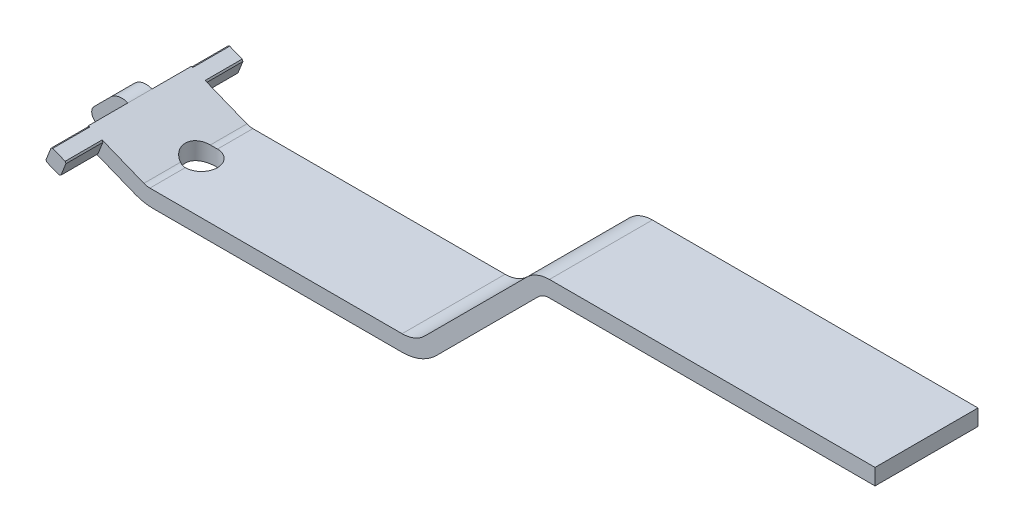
ISO-10303-21;
HEADER;
FILE_DESCRIPTION(('STEP AP214'),'2;1');
FILE_NAME('part.step','',(''),(''),'','','');
FILE_SCHEMA(('AUTOMOTIVE_DESIGN { 1 0 10303 214 1 1 1 1 }'));
ENDSEC;
DATA;
#1=APPLICATION_CONTEXT('core data for automotive mechanical design processes');
#2=APPLICATION_PROTOCOL_DEFINITION('international standard','automotive_design',2000,#1);
#3=PRODUCT_CONTEXT('',#1,'mechanical');
#4=PRODUCT('Part','Part','',(#3));
#5=PRODUCT_RELATED_PRODUCT_CATEGORY('part','',(#4));
#6=PRODUCT_DEFINITION_FORMATION('','',#4);
#7=PRODUCT_DEFINITION_CONTEXT('part definition',#1,'design');
#8=PRODUCT_DEFINITION('design','',#6,#7);
#9=PRODUCT_DEFINITION_SHAPE('','',#8);
#10=(LENGTH_UNIT() NAMED_UNIT(*) SI_UNIT(.MILLI.,.METRE.));
#11=(NAMED_UNIT(*) PLANE_ANGLE_UNIT() SI_UNIT($,.RADIAN.));
#12=(NAMED_UNIT(*) SI_UNIT($,.STERADIAN.) SOLID_ANGLE_UNIT());
#13=UNCERTAINTY_MEASURE_WITH_UNIT(LENGTH_MEASURE(1.E-05),#10,'distance_accuracy_value','');
#14=(GEOMETRIC_REPRESENTATION_CONTEXT(3) GLOBAL_UNCERTAINTY_ASSIGNED_CONTEXT((#13)) GLOBAL_UNIT_ASSIGNED_CONTEXT((#10,
#11,#12)) REPRESENTATION_CONTEXT('',''));
#15=CARTESIAN_POINT('',(0.,0.,0.));
#16=DIRECTION('',(0.,0.,1.));
#17=DIRECTION('',(1.,0.,0.));
#18=AXIS2_PLACEMENT_3D('',#15,#16,#17);
#19=CARTESIAN_POINT('',(3.73112428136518,1.2,3.2));
#20=DIRECTION('',(0.,0.,-1.));
#21=DIRECTION('',(-1.,0.,0.));
#22=AXIS2_PLACEMENT_3D('',#19,#20,#21);
#23=CYLINDRICAL_SURFACE('',#22,3.);
#24=CARTESIAN_POINT('',(2.61683856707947,-1.58538459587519,-0.387945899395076));
#25=CARTESIAN_POINT('',(2.639047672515,-1.59426285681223,-0.440770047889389));
#26=CARTESIAN_POINT('',(2.66571598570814,-1.60463297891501,-0.491380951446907));
#27=CARTESIAN_POINT('',(2.72699278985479,-1.62715226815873,-0.587054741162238));
#28=CARTESIAN_POINT('',(2.76159483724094,-1.63929998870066,-0.632122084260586));
#29=CARTESIAN_POINT('',(2.83776356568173,-1.66417616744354,-0.715636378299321));
#30=CARTESIAN_POINT('',(2.87932357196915,-1.67690406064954,-0.754089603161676));
#31=CARTESIAN_POINT('',(2.96843372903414,-1.70179977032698,-0.823522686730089));
#32=CARTESIAN_POINT('',(3.01598406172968,-1.7139675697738,-0.854502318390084));
#33=CARTESIAN_POINT('',(3.1167874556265,-1.73688632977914,-0.908550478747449));
#34=CARTESIAN_POINT('',(3.17012227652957,-1.74761033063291,-0.931478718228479));
#35=CARTESIAN_POINT('',(3.28035079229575,-1.76646697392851,-0.967840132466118));
#36=CARTESIAN_POINT('',(3.33724266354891,-1.7746009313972,-0.981278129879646));
#37=CARTESIAN_POINT('',(3.45048145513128,-1.78736378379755,-0.997686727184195));
#38=CARTESIAN_POINT('',(3.50675199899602,-1.79212481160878,-1.00107083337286));
#39=CARTESIAN_POINT('',(3.59114023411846,-1.79686651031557,-0.999014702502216));
#40=CARTESIAN_POINT('',(3.6193198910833,-1.79804704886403,-0.997130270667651));
#41=CARTESIAN_POINT('',(3.67544696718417,-1.79961498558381,-0.990983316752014));
#42=CARTESIAN_POINT('',(3.7033943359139,-1.80000221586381,-0.986720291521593));
#43=CARTESIAN_POINT('',(3.73112428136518,-1.8,-0.981276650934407));
#44=B_SPLINE_CURVE_WITH_KNOTS('',3,(#24,#25,#26,#27,#28,#29,#30,#31,#32,#33,#34,#35,#36,#37,#38,
#39,#40,#41,#42,#43),.UNSPECIFIED.,.F.,.F.,(4,2,2,2,2,2,2,2,2,4),(0.,0.173622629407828,
0.347104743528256,0.520421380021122,0.693743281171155,0.869950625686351,1.0460683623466,
1.2148347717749,1.29953835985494,1.38425987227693),.UNSPECIFIED.);
#45=CARTESIAN_POINT('',(2.61683856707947,-1.58538459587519,-0.387945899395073));
#46=VERTEX_POINT('',#45);
#47=CARTESIAN_POINT('',(3.73112428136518,-1.8,-0.981276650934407));
#48=VERTEX_POINT('',#47);
#49=EDGE_CURVE('E295',#46,#48,#44,.T.);
#50=ORIENTED_EDGE('',*,*,#49,.F.);
#51=DIRECTION('',(0.,0.,-1.));
#52=VECTOR('',#51,1.);
#53=CARTESIAN_POINT('',(2.61683856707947,-1.58538459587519,3.2));
#54=LINE('',#53,#52);
#55=CARTESIAN_POINT('',(2.61683856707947,-1.58538459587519,-3.2));
#56=VERTEX_POINT('',#55);
#57=EDGE_CURVE('E326',#56,#46,#54,.F.);
#58=ORIENTED_EDGE('',*,*,#57,.F.);
#59=CARTESIAN_POINT('',(3.73112428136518,1.2,-3.2));
#60=DIRECTION('',(0.,0.,1.));
#61=DIRECTION('',(1.,0.,0.));
#62=AXIS2_PLACEMENT_3D('',#59,#60,#61);
#63=CIRCLE('',#62,3.);
#64=CARTESIAN_POINT('',(3.73112428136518,-1.8,-3.2));
#65=VERTEX_POINT('',#64);
#66=EDGE_CURVE('E314',#65,#56,#63,.F.);
#67=ORIENTED_EDGE('',*,*,#66,.F.);
#68=DIRECTION('',(0.,0.,-1.));
#69=VECTOR('',#68,1.);
#70=CARTESIAN_POINT('',(3.73112428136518,-1.8,3.2));
#71=LINE('',#70,#69);
#72=EDGE_CURVE('E308',#48,#65,#71,.T.);
#73=ORIENTED_EDGE('',*,*,#72,.F.);
#74=EDGE_LOOP('',(#50,#58,#67,#73));
#75=FACE_BOUND('',#74,.T.);
#76=ADVANCED_FACE('F34',(#75),#23,.T.);
#77=CARTESIAN_POINT('',(3.53852071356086,0.2,3.2));
#78=DIRECTION('',(0.,0.,1.));
#79=DIRECTION('',(1.,0.,0.));
#80=AXIS2_PLACEMENT_3D('',#77,#78,#79);
#81=CYLINDRICAL_SURFACE('',#80,1.);
#82=DIRECTION('',(0.,0.,-1.));
#83=VECTOR('',#82,1.);
#84=CARTESIAN_POINT('',(3.53852071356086,-0.8,3.2));
#85=LINE('',#84,#83);
#86=CARTESIAN_POINT('',(3.53852071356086,-0.8,1.));
#87=VERTEX_POINT('',#86);
#88=CARTESIAN_POINT('',(3.53852071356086,-0.8,3.2));
#89=VERTEX_POINT('',#88);
#90=EDGE_CURVE('E334',#87,#89,#85,.F.);
#91=ORIENTED_EDGE('',*,*,#90,.F.);
#92=CARTESIAN_POINT('',(3.53852071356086,0.2,0.));
#93=DIRECTION('',(0.,0.707106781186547,0.707106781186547));
#94=DIRECTION('',(0.,-0.707106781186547,0.707106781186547));
#95=AXIS2_PLACEMENT_3D('',#92,#93,#94);
#96=ELLIPSE('',#95,1.41421356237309,1.);
#97=CARTESIAN_POINT('',(3.16709214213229,-0.728461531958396,0.928461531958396));
#98=VERTEX_POINT('',#97);
#99=EDGE_CURVE('E12',#87,#98,#96,.F.);
#100=ORIENTED_EDGE('',*,*,#99,.T.);
#101=DIRECTION('',(0.,0.,-1.));
#102=VECTOR('',#101,1.);
#103=CARTESIAN_POINT('',(3.16709214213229,-0.728461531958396,-3.2));
#104=LINE('',#103,#102);
#105=CARTESIAN_POINT('',(3.16709214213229,-0.728461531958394,3.2));
#106=VERTEX_POINT('',#105);
#107=EDGE_CURVE('E331',#106,#98,#104,.T.);
#108=ORIENTED_EDGE('',*,*,#107,.F.);
#109=CARTESIAN_POINT('',(3.53852071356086,0.2,3.2));
#110=DIRECTION('',(0.,0.,1.));
#111=DIRECTION('',(1.,0.,0.));
#112=AXIS2_PLACEMENT_3D('',#109,#110,#111);
#113=CIRCLE('',#112,1.);
#114=EDGE_CURVE('E340',#89,#106,#113,.F.);
#115=ORIENTED_EDGE('',*,*,#114,.F.);
#116=EDGE_LOOP('',(#91,#100,#108,#115));
#117=FACE_BOUND('',#116,.T.);
#118=ADVANCED_FACE('F651',(#117),#81,.F.);
#119=CARTESIAN_POINT('',(-0.278516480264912,0.649945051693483,3.2));
#120=DIRECTION('',(0.928461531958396,-0.371428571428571,0.));
#121=DIRECTION('',(0.371428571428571,0.928461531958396,0.));
#122=AXIS2_PLACEMENT_3D('',#119,#120,#121);
#123=PLANE('',#122);
#124=DIRECTION('',(0.371428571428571,0.928461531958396,0.));
#125=VECTOR('',#124,1.);
#126=CARTESIAN_POINT('',(-0.278516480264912,0.649945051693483,0.75));
#127=LINE('',#126,#125);
#128=CARTESIAN_POINT('',(-0.649945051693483,-0.278516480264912,0.75));
#129=VERTEX_POINT('',#128);
#130=CARTESIAN_POINT('',(-0.278516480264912,0.649945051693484,0.75));
#131=VERTEX_POINT('',#130);
#132=EDGE_CURVE('E428',#129,#131,#127,.T.);
#133=ORIENTED_EDGE('',*,*,#132,.F.);
#134=DIRECTION('',(0.,0.,-1.));
#135=VECTOR('',#134,1.);
#136=CARTESIAN_POINT('',(-0.649945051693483,-0.278516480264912,3.2));
#137=LINE('',#136,#135);
#138=CARTESIAN_POINT('',(-0.649945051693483,-0.278516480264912,3.2));
#139=VERTEX_POINT('',#138);
#140=EDGE_CURVE('E379',#139,#129,#137,.T.);
#141=ORIENTED_EDGE('',*,*,#140,.F.);
#142=DIRECTION('',(-0.371428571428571,-0.928461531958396,0.));
#143=VECTOR('',#142,1.);
#144=CARTESIAN_POINT('',(-0.278516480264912,0.649945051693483,3.2));
#145=LINE('',#144,#143);
#146=CARTESIAN_POINT('',(-0.618496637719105,-0.199904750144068,3.2));
#147=VERTEX_POINT('',#146);
#148=EDGE_CURVE('E544',#147,#139,#145,.T.);
#149=ORIENTED_EDGE('',*,*,#148,.F.);
#150=DIRECTION('',(0.,0.,1.));
#151=VECTOR('',#150,1.);
#152=CARTESIAN_POINT('',(-0.618496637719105,-0.199904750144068,-47.2865977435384));
#153=LINE('',#152,#151);
#154=CARTESIAN_POINT('',(-0.618496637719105,-0.199904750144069,5.5));
#155=VERTEX_POINT('',#154);
#156=EDGE_CURVE('E530',#155,#147,#153,.F.);
#157=ORIENTED_EDGE('',*,*,#156,.F.);
#158=DIRECTION('',(-0.371428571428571,-0.928461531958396,0.));
#159=VECTOR('',#158,1.);
#160=CARTESIAN_POINT('',(-0.278516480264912,0.649945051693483,5.5));
#161=LINE('',#160,#159);
#162=CARTESIAN_POINT('',(-0.309964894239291,0.57133332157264,5.5));
#163=VERTEX_POINT('',#162);
#164=EDGE_CURVE('E549',#163,#155,#161,.T.);
#165=ORIENTED_EDGE('',*,*,#164,.F.);
#166=DIRECTION('',(0.,0.,1.));
#167=VECTOR('',#166,1.);
#168=CARTESIAN_POINT('',(-0.309964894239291,0.57133332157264,-47.2865977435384));
#169=LINE('',#168,#167);
#170=CARTESIAN_POINT('',(-0.309964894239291,0.57133332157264,3.2));
#171=VERTEX_POINT('',#170);
#172=EDGE_CURVE('E532',#171,#163,#169,.T.);
#173=ORIENTED_EDGE('',*,*,#172,.F.);
#174=CARTESIAN_POINT('',(-0.278516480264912,0.649945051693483,3.2));
#175=VERTEX_POINT('',#174);
#176=EDGE_CURVE('E542',#175,#171,#145,.T.);
#177=ORIENTED_EDGE('',*,*,#176,.F.);
#178=DIRECTION('',(0.,0.,-1.));
#179=VECTOR('',#178,1.);
#180=CARTESIAN_POINT('',(-0.278516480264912,0.649945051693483,3.2));
#181=LINE('',#180,#179);
#182=EDGE_CURVE('E418',#175,#131,#181,.T.);
#183=ORIENTED_EDGE('',*,*,#182,.T.);
#184=EDGE_LOOP('',(#133,#141,#149,#157,#165,#173,#177,#183));
#185=FACE_BOUND('',#184,.T.);
#186=ADVANCED_FACE('F656',(#185),#123,.F.);
#187=CARTESIAN_POINT('',(0.185714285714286,0.464230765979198,3.2));
#188=DIRECTION('',(-0.371428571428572,-0.928461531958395,0.));
#189=DIRECTION('',(0.928461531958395,-0.371428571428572,0.));
#190=AXIS2_PLACEMENT_3D('',#187,#188,#189);
#191=PLANE('',#190);
#192=ORIENTED_EDGE('',*,*,#107,.T.);
#193=CARTESIAN_POINT('',(3.53852071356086,-0.877050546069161,0.));
#194=DIRECTION('',(-0.371428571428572,-0.928461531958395,0.));
#195=DIRECTION('',(-0.928461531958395,0.371428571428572,0.));
#196=AXIS2_PLACEMENT_3D('',#193,#194,#195);
#197=ELLIPSE('',#196,1.07705054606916,1.);
#198=CARTESIAN_POINT('',(3.16709214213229,-0.728461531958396,-0.928461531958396));
#199=VERTEX_POINT('',#198);
#200=EDGE_CURVE('E672',#98,#199,#197,.T.);
#201=ORIENTED_EDGE('',*,*,#200,.T.);
#202=CARTESIAN_POINT('',(3.16709214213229,-0.728461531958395,-3.2));
#203=VERTEX_POINT('',#202);
#204=EDGE_CURVE('E330',#199,#203,#104,.T.);
#205=ORIENTED_EDGE('',*,*,#204,.T.);
#206=DIRECTION('',(-0.928461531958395,0.371428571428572,0.));
#207=VECTOR('',#206,1.);
#208=CARTESIAN_POINT('',(0.185714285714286,0.464230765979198,-3.2));
#209=LINE('',#208,#207);
#210=CARTESIAN_POINT('',(0.57133332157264,0.309964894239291,-3.2));
#211=VERTEX_POINT('',#210);
#212=EDGE_CURVE('E358',#203,#211,#209,.T.);
#213=ORIENTED_EDGE('',*,*,#212,.T.);
#214=DIRECTION('',(0.,0.,-1.));
#215=VECTOR('',#214,1.);
#216=CARTESIAN_POINT('',(0.57133332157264,0.309964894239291,47.2865977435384));
#217=LINE('',#216,#215);
#218=CARTESIAN_POINT('',(0.57133332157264,0.309964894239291,-5.5));
#219=VERTEX_POINT('',#218);
#220=EDGE_CURVE('E508',#219,#211,#217,.F.);
#221=ORIENTED_EDGE('',*,*,#220,.F.);
#222=DIRECTION('',(-0.928461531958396,0.371428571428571,0.));
#223=VECTOR('',#222,1.);
#224=CARTESIAN_POINT('',(-0.278516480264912,0.649945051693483,-5.5));
#225=LINE('',#224,#223);
#226=CARTESIAN_POINT('',(-0.199904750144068,0.618496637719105,-5.5));
#227=VERTEX_POINT('',#226);
#228=EDGE_CURVE('E541',#219,#227,#225,.T.);
#229=ORIENTED_EDGE('',*,*,#228,.T.);
#230=DIRECTION('',(0.,0.,-1.));
#231=VECTOR('',#230,1.);
#232=CARTESIAN_POINT('',(-0.199904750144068,0.618496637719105,47.2865977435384));
#233=LINE('',#232,#231);
#234=CARTESIAN_POINT('',(-0.199904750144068,0.618496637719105,-3.2));
#235=VERTEX_POINT('',#234);
#236=EDGE_CURVE('E511',#235,#227,#233,.T.);
#237=ORIENTED_EDGE('',*,*,#236,.F.);
#238=DIRECTION('',(-0.928461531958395,0.371428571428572,0.));
#239=VECTOR('',#238,1.);
#240=CARTESIAN_POINT('',(0.185714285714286,0.464230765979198,-3.2));
#241=LINE('',#240,#239);
#242=CARTESIAN_POINT('',(-0.278516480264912,0.649945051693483,-3.2));
#243=VERTEX_POINT('',#242);
#244=EDGE_CURVE('E491',#235,#243,#241,.T.);
#245=ORIENTED_EDGE('',*,*,#244,.T.);
#246=CARTESIAN_POINT('',(-0.278516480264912,0.649945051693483,-0.75));
#247=VERTEX_POINT('',#246);
#248=EDGE_CURVE('E381',#247,#243,#181,.T.);
#249=ORIENTED_EDGE('',*,*,#248,.F.);
#250=DIRECTION('',(0.,0.,-1.));
#251=VECTOR('',#250,1.);
#252=CARTESIAN_POINT('',(-0.278516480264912,0.649945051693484,0.75));
#253=LINE('',#252,#251);
#254=EDGE_CURVE('E435',#131,#247,#253,.T.);
#255=ORIENTED_EDGE('',*,*,#254,.F.);
#256=ORIENTED_EDGE('',*,*,#182,.F.);
#257=DIRECTION('',(-0.928461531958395,0.371428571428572,0.));
#258=VECTOR('',#257,1.);
#259=CARTESIAN_POINT('',(0.185714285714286,0.464230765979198,3.2));
#260=LINE('',#259,#258);
#261=CARTESIAN_POINT('',(-0.199904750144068,0.618496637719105,3.2));
#262=VERTEX_POINT('',#261);
#263=EDGE_CURVE('E539',#262,#175,#260,.T.);
#264=ORIENTED_EDGE('',*,*,#263,.F.);
#265=DIRECTION('',(0.,0.,1.));
#266=VECTOR('',#265,1.);
#267=CARTESIAN_POINT('',(-0.199904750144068,0.618496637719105,-47.2865977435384));
#268=LINE('',#267,#266);
#269=CARTESIAN_POINT('',(-0.199904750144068,0.618496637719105,5.5));
#270=VERTEX_POINT('',#269);
#271=EDGE_CURVE('E534',#270,#262,#268,.F.);
#272=ORIENTED_EDGE('',*,*,#271,.F.);
#273=DIRECTION('',(-0.928461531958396,0.371428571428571,0.));
#274=VECTOR('',#273,1.);
#275=CARTESIAN_POINT('',(-0.278516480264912,0.649945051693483,5.5));
#276=LINE('',#275,#274);
#277=CARTESIAN_POINT('',(0.57133332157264,0.309964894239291,5.5));
#278=VERTEX_POINT('',#277);
#279=EDGE_CURVE('E546',#278,#270,#276,.T.);
#280=ORIENTED_EDGE('',*,*,#279,.F.);
#281=DIRECTION('',(0.,0.,1.));
#282=VECTOR('',#281,1.);
#283=CARTESIAN_POINT('',(0.57133332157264,0.309964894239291,-47.2865977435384));
#284=LINE('',#283,#282);
#285=CARTESIAN_POINT('',(0.57133332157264,0.309964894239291,3.2));
#286=VERTEX_POINT('',#285);
#287=EDGE_CURVE('E536',#286,#278,#284,.T.);
#288=ORIENTED_EDGE('',*,*,#287,.F.);
#289=DIRECTION('',(-0.928461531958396,0.371428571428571,0.));
#290=VECTOR('',#289,1.);
#291=CARTESIAN_POINT('',(0.185714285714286,0.464230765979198,3.2));
#292=LINE('',#291,#290);
#293=EDGE_CURVE('E595',#106,#286,#292,.T.);
#294=ORIENTED_EDGE('',*,*,#293,.F.);
#295=EDGE_LOOP('',(#192,#201,#205,#213,#221,#229,#237,#245,#249,#255,#256,#264,#272,#280,#288,#294));
#296=FACE_BOUND('',#295,.T.);
#297=ADVANCED_FACE('F771',(#296),#191,.F.);
#298=CARTESIAN_POINT('',(-0.649945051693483,-0.278516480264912,-0.75));
#299=VERTEX_POINT('',#298);
#300=CARTESIAN_POINT('',(-0.649945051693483,-0.278516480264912,-3.2));
#301=VERTEX_POINT('',#300);
#302=EDGE_CURVE('E376',#299,#301,#137,.T.);
#303=ORIENTED_EDGE('',*,*,#302,.F.);
#304=DIRECTION('',(0.371428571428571,0.928461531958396,0.));
#305=VECTOR('',#304,1.);
#306=CARTESIAN_POINT('',(-0.278516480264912,0.649945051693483,-0.75));
#307=LINE('',#306,#305);
#308=EDGE_CURVE('E303',#299,#247,#307,.T.);
#309=ORIENTED_EDGE('',*,*,#308,.T.);
#310=ORIENTED_EDGE('',*,*,#248,.T.);
#311=DIRECTION('',(-0.371428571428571,-0.928461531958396,0.));
#312=VECTOR('',#311,1.);
#313=CARTESIAN_POINT('',(-0.278516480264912,0.649945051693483,-3.2));
#314=LINE('',#313,#312);
#315=CARTESIAN_POINT('',(-0.309964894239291,0.57133332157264,-3.2));
#316=VERTEX_POINT('',#315);
#317=EDGE_CURVE('E495',#243,#316,#314,.T.);
#318=ORIENTED_EDGE('',*,*,#317,.T.);
#319=DIRECTION('',(0.,0.,-1.));
#320=VECTOR('',#319,1.);
#321=CARTESIAN_POINT('',(-0.309964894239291,0.57133332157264,47.2865977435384));
#322=LINE('',#321,#320);
#323=CARTESIAN_POINT('',(-0.309964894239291,0.57133332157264,-5.5));
#324=VERTEX_POINT('',#323);
#325=EDGE_CURVE('E504',#324,#316,#322,.F.);
#326=ORIENTED_EDGE('',*,*,#325,.F.);
#327=DIRECTION('',(-0.371428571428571,-0.928461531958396,0.));
#328=VECTOR('',#327,1.);
#329=CARTESIAN_POINT('',(-0.278516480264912,0.649945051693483,-5.5));
#330=LINE('',#329,#328);
#331=CARTESIAN_POINT('',(-0.618496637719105,-0.199904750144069,-5.5));
#332=VERTEX_POINT('',#331);
#333=EDGE_CURVE('E562',#324,#332,#330,.T.);
#334=ORIENTED_EDGE('',*,*,#333,.T.);
#335=DIRECTION('',(0.,0.,-1.));
#336=VECTOR('',#335,1.);
#337=CARTESIAN_POINT('',(-0.618496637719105,-0.199904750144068,47.2865977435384));
#338=LINE('',#337,#336);
#339=CARTESIAN_POINT('',(-0.618496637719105,-0.199904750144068,-3.2));
#340=VERTEX_POINT('',#339);
#341=EDGE_CURVE('E506',#340,#332,#338,.T.);
#342=ORIENTED_EDGE('',*,*,#341,.F.);
#343=EDGE_CURVE('E498',#340,#301,#314,.T.);
#344=ORIENTED_EDGE('',*,*,#343,.T.);
#345=EDGE_LOOP('',(#303,#309,#310,#318,#326,#334,#342,#344));
#346=FACE_BOUND('',#345,.T.);
#347=ADVANCED_FACE('F767',(#346),#123,.F.);
#348=CARTESIAN_POINT('',(-0.185714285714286,-0.464230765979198,3.2));
#349=DIRECTION('',(0.371428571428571,0.928461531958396,0.));
#350=DIRECTION('',(-0.928461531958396,0.371428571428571,0.));
#351=AXIS2_PLACEMENT_3D('',#348,#349,#350);
#352=PLANE('',#351);
#353=ORIENTED_EDGE('',*,*,#57,.T.);
#354=CARTESIAN_POINT('',(3.53852071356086,-1.95410109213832,0.));
#355=DIRECTION('',(0.371428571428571,0.928461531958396,0.));
#356=DIRECTION('',(-0.928461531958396,0.371428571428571,0.));
#357=AXIS2_PLACEMENT_3D('',#354,#355,#356);
#358=ELLIPSE('',#357,1.07705054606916,1.);
#359=CARTESIAN_POINT('',(2.61683856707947,-1.58538459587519,0.387945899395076));
#360=VERTEX_POINT('',#359);
#361=EDGE_CURVE('E298',#46,#360,#358,.T.);
#362=ORIENTED_EDGE('',*,*,#361,.T.);
#363=CARTESIAN_POINT('',(2.61683856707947,-1.58538459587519,3.2));
#364=VERTEX_POINT('',#363);
#365=EDGE_CURVE('E325',#360,#364,#54,.F.);
#366=ORIENTED_EDGE('',*,*,#365,.T.);
#367=DIRECTION('',(0.928461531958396,-0.371428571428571,0.));
#368=VECTOR('',#367,1.);
#369=CARTESIAN_POINT('',(-0.649945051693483,-0.278516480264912,3.2));
#370=LINE('',#369,#368);
#371=CARTESIAN_POINT('',(0.199904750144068,-0.618496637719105,3.2));
#372=VERTEX_POINT('',#371);
#373=EDGE_CURVE('E597',#372,#364,#370,.T.);
#374=ORIENTED_EDGE('',*,*,#373,.F.);
#375=DIRECTION('',(0.,0.,1.));
#376=VECTOR('',#375,1.);
#377=CARTESIAN_POINT('',(0.199904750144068,-0.618496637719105,-47.2865977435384));
#378=LINE('',#377,#376);
#379=CARTESIAN_POINT('',(0.199904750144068,-0.618496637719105,5.5));
#380=VERTEX_POINT('',#379);
#381=EDGE_CURVE('E525',#380,#372,#378,.F.);
#382=ORIENTED_EDGE('',*,*,#381,.F.);
#383=DIRECTION('',(0.928461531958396,-0.371428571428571,0.));
#384=VECTOR('',#383,1.);
#385=CARTESIAN_POINT('',(-0.649945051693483,-0.278516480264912,5.5));
#386=LINE('',#385,#384);
#387=CARTESIAN_POINT('',(-0.571333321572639,-0.309964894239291,5.5));
#388=VERTEX_POINT('',#387);
#389=EDGE_CURVE('E553',#388,#380,#386,.T.);
#390=ORIENTED_EDGE('',*,*,#389,.F.);
#391=DIRECTION('',(0.,0.,1.));
#392=VECTOR('',#391,1.);
#393=CARTESIAN_POINT('',(-0.57133332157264,-0.309964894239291,-47.2865977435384));
#394=LINE('',#393,#392);
#395=CARTESIAN_POINT('',(-0.57133332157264,-0.309964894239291,3.2));
#396=VERTEX_POINT('',#395);
#397=EDGE_CURVE('E528',#396,#388,#394,.T.);
#398=ORIENTED_EDGE('',*,*,#397,.F.);
#399=DIRECTION('',(0.928461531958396,-0.371428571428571,0.));
#400=VECTOR('',#399,1.);
#401=CARTESIAN_POINT('',(-0.185714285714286,-0.464230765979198,3.2));
#402=LINE('',#401,#400);
#403=EDGE_CURVE('E538',#139,#396,#402,.T.);
#404=ORIENTED_EDGE('',*,*,#403,.F.);
#405=ORIENTED_EDGE('',*,*,#140,.T.);
#406=DIRECTION('',(0.,0.,-1.));
#407=VECTOR('',#406,1.);
#408=CARTESIAN_POINT('',(-0.649945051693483,-0.278516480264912,0.75));
#409=LINE('',#408,#407);
#410=EDGE_CURVE('E476',#129,#299,#409,.T.);
#411=ORIENTED_EDGE('',*,*,#410,.T.);
#412=ORIENTED_EDGE('',*,*,#302,.T.);
#413=DIRECTION('',(0.928461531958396,-0.371428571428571,0.));
#414=VECTOR('',#413,1.);
#415=CARTESIAN_POINT('',(-0.185714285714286,-0.464230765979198,-3.2));
#416=LINE('',#415,#414);
#417=CARTESIAN_POINT('',(-0.57133332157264,-0.309964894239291,-3.2));
#418=VERTEX_POINT('',#417);
#419=EDGE_CURVE('E489',#301,#418,#416,.T.);
#420=ORIENTED_EDGE('',*,*,#419,.T.);
#421=DIRECTION('',(0.,0.,-1.));
#422=VECTOR('',#421,1.);
#423=CARTESIAN_POINT('',(-0.57133332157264,-0.309964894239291,47.2865977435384));
#424=LINE('',#423,#422);
#425=CARTESIAN_POINT('',(-0.571333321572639,-0.309964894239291,-5.5));
#426=VERTEX_POINT('',#425);
#427=EDGE_CURVE('E494',#426,#418,#424,.F.);
#428=ORIENTED_EDGE('',*,*,#427,.F.);
#429=DIRECTION('',(0.928461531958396,-0.371428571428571,0.));
#430=VECTOR('',#429,1.);
#431=CARTESIAN_POINT('',(-0.649945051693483,-0.278516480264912,-5.5));
#432=LINE('',#431,#430);
#433=CARTESIAN_POINT('',(0.199904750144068,-0.618496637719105,-5.5));
#434=VERTEX_POINT('',#433);
#435=EDGE_CURVE('E565',#426,#434,#432,.T.);
#436=ORIENTED_EDGE('',*,*,#435,.T.);
#437=DIRECTION('',(0.,0.,-1.));
#438=VECTOR('',#437,1.);
#439=CARTESIAN_POINT('',(0.199904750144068,-0.618496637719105,47.2865977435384));
#440=LINE('',#439,#438);
#441=CARTESIAN_POINT('',(0.199904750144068,-0.618496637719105,-3.2));
#442=VERTEX_POINT('',#441);
#443=EDGE_CURVE('E502',#442,#434,#440,.T.);
#444=ORIENTED_EDGE('',*,*,#443,.F.);
#445=DIRECTION('',(0.928461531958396,-0.371428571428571,0.));
#446=VECTOR('',#445,1.);
#447=CARTESIAN_POINT('',(-0.185714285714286,-0.464230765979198,-3.2));
#448=LINE('',#447,#446);
#449=EDGE_CURVE('E361',#442,#56,#448,.T.);
#450=ORIENTED_EDGE('',*,*,#449,.T.);
#451=EDGE_LOOP('',(#353,#362,#366,#374,#382,#390,#398,#404,#405,#411,#412,#420,#428,#436,#444,#450));
#452=FACE_BOUND('',#451,.T.);
#453=ADVANCED_FACE('F717',(#452),#352,.F.);
#454=CARTESIAN_POINT('',(0.649945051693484,0.278516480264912,-5.5));
#455=DIRECTION('',(0.,0.,-1.));
#456=DIRECTION('',(-1.,0.,0.));
#457=AXIS2_PLACEMENT_3D('',#454,#455,#456);
#458=PLANE('',#457);
#459=ORIENTED_EDGE('',*,*,#333,.F.);
#460=CARTESIAN_POINT('',(0.,0.,-5.5));
#461=DIRECTION('',(0.,0.,-1.));
#462=DIRECTION('',(-1.,0.,0.));
#463=AXIS2_PLACEMENT_3D('',#460,#461,#462);
#464=CIRCLE('',#463,0.65);
#465=EDGE_CURVE('E480',#324,#227,#464,.T.);
#466=ORIENTED_EDGE('',*,*,#465,.T.);
#467=ORIENTED_EDGE('',*,*,#228,.F.);
#468=CARTESIAN_POINT('',(0.618496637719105,0.199904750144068,-5.5));
#469=VERTEX_POINT('',#468);
#470=EDGE_CURVE('E484',#219,#469,#464,.T.);
#471=ORIENTED_EDGE('',*,*,#470,.T.);
#472=DIRECTION('',(0.371428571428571,0.928461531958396,0.));
#473=VECTOR('',#472,1.);
#474=CARTESIAN_POINT('',(0.649945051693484,0.278516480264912,-5.5));
#475=LINE('',#474,#473);
#476=CARTESIAN_POINT('',(0.309964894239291,-0.571333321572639,-5.5));
#477=VERTEX_POINT('',#476);
#478=EDGE_CURVE('E550',#477,#469,#475,.T.);
#479=ORIENTED_EDGE('',*,*,#478,.F.);
#480=EDGE_CURVE('E791',#477,#434,#464,.T.);
#481=ORIENTED_EDGE('',*,*,#480,.T.);
#482=ORIENTED_EDGE('',*,*,#435,.F.);
#483=EDGE_CURVE('E485',#426,#332,#464,.T.);
#484=ORIENTED_EDGE('',*,*,#483,.T.);
#485=EDGE_LOOP('',(#459,#466,#467,#471,#479,#481,#482,#484));
#486=FACE_BOUND('',#485,.T.);
#487=ADVANCED_FACE('F713',(#486),#458,.T.);
#488=CARTESIAN_POINT('',(0.649945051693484,0.278516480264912,5.5));
#489=DIRECTION('',(-0.928461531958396,0.371428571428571,0.));
#490=DIRECTION('',(-0.371428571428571,-0.928461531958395,0.));
#491=AXIS2_PLACEMENT_3D('',#488,#489,#490);
#492=PLANE('',#491);
#493=DIRECTION('',(0.,0.,-1.));
#494=VECTOR('',#493,1.);
#495=CARTESIAN_POINT('',(0.618496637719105,0.199904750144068,47.2865977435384));
#496=LINE('',#495,#494);
#497=CARTESIAN_POINT('',(0.618496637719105,0.199904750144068,-3.2));
#498=VERTEX_POINT('',#497);
#499=EDGE_CURVE('E316',#498,#469,#496,.T.);
#500=ORIENTED_EDGE('',*,*,#499,.F.);
#501=DIRECTION('',(-0.371428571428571,-0.928461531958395,0.));
#502=VECTOR('',#501,1.);
#503=CARTESIAN_POINT('',(3.52881832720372,7.47484788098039,-3.2));
#504=LINE('',#503,#502);
#505=CARTESIAN_POINT('',(0.309964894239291,-0.571333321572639,-3.2));
#506=VERTEX_POINT('',#505);
#507=EDGE_CURVE('E389',#498,#506,#504,.T.);
#508=ORIENTED_EDGE('',*,*,#507,.T.);
#509=DIRECTION('',(0.,0.,-1.));
#510=VECTOR('',#509,1.);
#511=CARTESIAN_POINT('',(0.309964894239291,-0.571333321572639,47.2865977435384));
#512=LINE('',#511,#510);
#513=EDGE_CURVE('E318',#477,#506,#512,.F.);
#514=ORIENTED_EDGE('',*,*,#513,.F.);
#515=ORIENTED_EDGE('',*,*,#478,.T.);
#516=EDGE_LOOP('',(#500,#508,#514,#515));
#517=FACE_BOUND('',#516,.T.);
#518=ADVANCED_FACE('F716',(#517),#492,.F.);
#519=DIRECTION('',(0.,0.,1.));
#520=VECTOR('',#519,1.);
#521=CARTESIAN_POINT('',(0.309964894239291,-0.571333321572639,-47.2865977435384));
#522=LINE('',#521,#520);
#523=CARTESIAN_POINT('',(0.309964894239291,-0.571333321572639,3.2));
#524=VERTEX_POINT('',#523);
#525=CARTESIAN_POINT('',(0.309964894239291,-0.571333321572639,5.5));
#526=VERTEX_POINT('',#525);
#527=EDGE_CURVE('E523',#524,#526,#522,.T.);
#528=ORIENTED_EDGE('',*,*,#527,.F.);
#529=DIRECTION('',(-0.371428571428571,-0.928461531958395,0.));
#530=VECTOR('',#529,1.);
#531=CARTESIAN_POINT('',(3.52881832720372,7.47484788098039,3.2));
#532=LINE('',#531,#530);
#533=CARTESIAN_POINT('',(0.618496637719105,0.199904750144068,3.2));
#534=VERTEX_POINT('',#533);
#535=EDGE_CURVE('E559',#534,#524,#532,.T.);
#536=ORIENTED_EDGE('',*,*,#535,.F.);
#537=DIRECTION('',(0.,0.,1.));
#538=VECTOR('',#537,1.);
#539=CARTESIAN_POINT('',(0.618496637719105,0.199904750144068,-47.2865977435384));
#540=LINE('',#539,#538);
#541=CARTESIAN_POINT('',(0.618496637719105,0.199904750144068,5.5));
#542=VERTEX_POINT('',#541);
#543=EDGE_CURVE('E520',#542,#534,#540,.F.);
#544=ORIENTED_EDGE('',*,*,#543,.F.);
#545=DIRECTION('',(0.371428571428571,0.928461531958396,0.));
#546=VECTOR('',#545,1.);
#547=CARTESIAN_POINT('',(0.649945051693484,0.278516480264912,5.5));
#548=LINE('',#547,#546);
#549=EDGE_CURVE('E556',#526,#542,#548,.T.);
#550=ORIENTED_EDGE('',*,*,#549,.F.);
#551=EDGE_LOOP('',(#528,#536,#544,#550));
#552=FACE_BOUND('',#551,.T.);
#553=ADVANCED_FACE('F711',(#552),#492,.F.);
#554=CARTESIAN_POINT('',(0.649945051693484,0.278516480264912,5.5));
#555=DIRECTION('',(0.,0.,-1.));
#556=DIRECTION('',(-1.,0.,0.));
#557=AXIS2_PLACEMENT_3D('',#554,#555,#556);
#558=PLANE('',#557);
#559=CARTESIAN_POINT('',(0.,0.,5.5));
#560=DIRECTION('',(0.,0.,-1.));
#561=DIRECTION('',(-1.,0.,0.));
#562=AXIS2_PLACEMENT_3D('',#559,#560,#561);
#563=CIRCLE('',#562,0.65);
#564=EDGE_CURVE('E385',#163,#270,#563,.T.);
#565=ORIENTED_EDGE('',*,*,#564,.F.);
#566=ORIENTED_EDGE('',*,*,#164,.T.);
#567=EDGE_CURVE('E386',#388,#155,#563,.T.);
#568=ORIENTED_EDGE('',*,*,#567,.F.);
#569=ORIENTED_EDGE('',*,*,#389,.T.);
#570=EDGE_CURVE('E388',#526,#380,#563,.T.);
#571=ORIENTED_EDGE('',*,*,#570,.F.);
#572=ORIENTED_EDGE('',*,*,#549,.T.);
#573=CARTESIAN_POINT('',(0.,0.,5.5));
#574=DIRECTION('',(0.,0.,1.));
#575=DIRECTION('',(1.,0.,0.));
#576=AXIS2_PLACEMENT_3D('',#573,#574,#575);
#577=CIRCLE('',#576,0.65);
#578=EDGE_CURVE('E513',#542,#278,#577,.T.);
#579=ORIENTED_EDGE('',*,*,#578,.T.);
#580=ORIENTED_EDGE('',*,*,#279,.T.);
#581=EDGE_LOOP('',(#565,#566,#568,#569,#571,#572,#579,#580));
#582=FACE_BOUND('',#581,.T.);
#583=ADVANCED_FACE('F637',(#582),#558,.F.);
#584=CARTESIAN_POINT('',(19.2140814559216,1.2,3.2));
#585=DIRECTION('',(0.,0.,1.));
#586=DIRECTION('',(1.,0.,0.));
#587=AXIS2_PLACEMENT_3D('',#584,#585,#586);
#588=PLANE('',#587);
#589=ORIENTED_EDGE('',*,*,#373,.T.);
#590=CARTESIAN_POINT('',(3.73112428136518,1.2,3.2));
#591=DIRECTION('',(0.,0.,1.));
#592=DIRECTION('',(1.,0.,0.));
#593=AXIS2_PLACEMENT_3D('',#590,#591,#592);
#594=CIRCLE('',#593,3.);
#595=CARTESIAN_POINT('',(3.73112428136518,-1.8,3.2));
#596=VERTEX_POINT('',#595);
#597=EDGE_CURVE('E328',#364,#596,#594,.T.);
#598=ORIENTED_EDGE('',*,*,#597,.T.);
#599=DIRECTION('',(1.,0.,0.));
#600=VECTOR('',#599,1.);
#601=CARTESIAN_POINT('',(3.15331357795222,-1.8,3.2));
#602=LINE('',#601,#600);
#603=CARTESIAN_POINT('',(19.2140814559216,-1.8,3.2));
#604=VERTEX_POINT('',#603);
#605=EDGE_CURVE('E369',#596,#604,#602,.T.);
#606=ORIENTED_EDGE('',*,*,#605,.T.);
#607=CARTESIAN_POINT('',(19.2140814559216,1.2,3.2));
#608=DIRECTION('',(0.,0.,1.));
#609=DIRECTION('',(1.,0.,0.));
#610=AXIS2_PLACEMENT_3D('',#607,#608,#609);
#611=CIRCLE('',#610,3.);
#612=CARTESIAN_POINT('',(21.3354017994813,-0.921320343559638,3.2));
#613=VERTEX_POINT('',#612);
#614=EDGE_CURVE('E574',#604,#613,#611,.T.);
#615=ORIENTED_EDGE('',*,*,#614,.T.);
#616=DIRECTION('',(0.707106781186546,0.707106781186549,0.));
#617=VECTOR('',#616,1.);
#618=CARTESIAN_POINT('',(21.3354017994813,-0.921320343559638,3.2));
#619=LINE('',#618,#617);
#620=CARTESIAN_POINT('',(27.6638289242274,5.40710678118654,3.2));
#621=VERTEX_POINT('',#620);
#622=EDGE_CURVE('E576',#613,#621,#619,.T.);
#623=ORIENTED_EDGE('',*,*,#622,.T.);
#624=CARTESIAN_POINT('',(28.370935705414,4.7,3.2));
#625=DIRECTION('',(0.,0.,-1.));
#626=DIRECTION('',(-1.,0.,0.));
#627=AXIS2_PLACEMENT_3D('',#624,#625,#626);
#628=CIRCLE('',#627,1.);
#629=CARTESIAN_POINT('',(28.370935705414,5.7,3.2));
#630=VERTEX_POINT('',#629);
#631=EDGE_CURVE('E578',#621,#630,#628,.T.);
#632=ORIENTED_EDGE('',*,*,#631,.T.);
#633=DIRECTION('',(1.,0.,0.));
#634=VECTOR('',#633,1.);
#635=CARTESIAN_POINT('',(28.370935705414,5.7,3.2));
#636=LINE('',#635,#634);
#637=CARTESIAN_POINT('',(48.60617244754,5.7,3.2));
#638=VERTEX_POINT('',#637);
#639=EDGE_CURVE('E580',#630,#638,#636,.T.);
#640=ORIENTED_EDGE('',*,*,#639,.T.);
#641=DIRECTION('',(0.,1.,0.));
#642=VECTOR('',#641,1.);
#643=CARTESIAN_POINT('',(48.60617244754,6.7,3.2));
#644=LINE('',#643,#642);
#645=CARTESIAN_POINT('',(48.60617244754,6.7,3.2));
#646=VERTEX_POINT('',#645);
#647=EDGE_CURVE('E582',#638,#646,#644,.T.);
#648=ORIENTED_EDGE('',*,*,#647,.T.);
#649=DIRECTION('',(-1.,0.,0.));
#650=VECTOR('',#649,1.);
#651=CARTESIAN_POINT('',(28.370935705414,6.7,3.2));
#652=LINE('',#651,#650);
#653=CARTESIAN_POINT('',(28.370935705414,6.7,3.2));
#654=VERTEX_POINT('',#653);
#655=EDGE_CURVE('E584',#646,#654,#652,.T.);
#656=ORIENTED_EDGE('',*,*,#655,.T.);
#657=CARTESIAN_POINT('',(28.370935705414,4.7,3.2));
#658=DIRECTION('',(0.,0.,1.));
#659=DIRECTION('',(1.,0.,0.));
#660=AXIS2_PLACEMENT_3D('',#657,#658,#659);
#661=CIRCLE('',#660,2.);
#662=CARTESIAN_POINT('',(26.9567221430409,6.11421356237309,3.2));
#663=VERTEX_POINT('',#662);
#664=EDGE_CURVE('E586',#654,#663,#661,.T.);
#665=ORIENTED_EDGE('',*,*,#664,.T.);
#666=DIRECTION('',(-0.707106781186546,-0.707106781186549,0.));
#667=VECTOR('',#666,1.);
#668=CARTESIAN_POINT('',(20.6282950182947,-0.214213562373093,3.2));
#669=LINE('',#668,#667);
#670=CARTESIAN_POINT('',(20.6282950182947,-0.214213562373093,3.2));
#671=VERTEX_POINT('',#670);
#672=EDGE_CURVE('E588',#663,#671,#669,.T.);
#673=ORIENTED_EDGE('',*,*,#672,.T.);
#674=CARTESIAN_POINT('',(19.2140814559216,1.2,3.2));
#675=DIRECTION('',(0.,0.,-1.));
#676=DIRECTION('',(1.,0.,0.));
#677=AXIS2_PLACEMENT_3D('',#674,#675,#676);
#678=CIRCLE('',#677,2.);
#679=CARTESIAN_POINT('',(19.2140814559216,-0.8,3.2));
#680=VERTEX_POINT('',#679);
#681=EDGE_CURVE('E590',#671,#680,#678,.T.);
#682=ORIENTED_EDGE('',*,*,#681,.T.);
#683=DIRECTION('',(-1.,0.,0.));
#684=VECTOR('',#683,1.);
#685=CARTESIAN_POINT('',(3.34591714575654,-0.8,3.2));
#686=LINE('',#685,#684);
#687=EDGE_CURVE('E592',#680,#89,#686,.T.);
#688=ORIENTED_EDGE('',*,*,#687,.T.);
#689=ORIENTED_EDGE('',*,*,#114,.T.);
#690=ORIENTED_EDGE('',*,*,#293,.T.);
#691=CARTESIAN_POINT('',(0.,0.,3.2));
#692=DIRECTION('',(0.,0.,1.));
#693=DIRECTION('',(1.,0.,0.));
#694=AXIS2_PLACEMENT_3D('',#691,#692,#693);
#695=CIRCLE('',#694,0.65);
#696=EDGE_CURVE('E516',#286,#534,#695,.F.);
#697=ORIENTED_EDGE('',*,*,#696,.T.);
#698=ORIENTED_EDGE('',*,*,#535,.T.);
#699=EDGE_CURVE('E517',#524,#372,#695,.F.);
#700=ORIENTED_EDGE('',*,*,#699,.T.);
#701=EDGE_LOOP('',(#589,#598,#606,#615,#623,#632,#640,#648,#656,#665,#673,#682,#688,#689,#690,
#697,#698,#700));
#702=FACE_BOUND('',#701,.T.);
#703=ADVANCED_FACE('F627',(#702),#588,.T.);
#704=CARTESIAN_POINT('',(19.2140814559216,1.2,-3.2));
#705=DIRECTION('',(0.,0.,1.));
#706=DIRECTION('',(1.,0.,0.));
#707=AXIS2_PLACEMENT_3D('',#704,#705,#706);
#708=PLANE('',#707);
#709=DIRECTION('',(1.,0.,0.));
#710=VECTOR('',#709,1.);
#711=CARTESIAN_POINT('',(3.15331357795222,-1.8,-3.2));
#712=LINE('',#711,#710);
#713=CARTESIAN_POINT('',(19.2140814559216,-1.8,-3.2));
#714=VERTEX_POINT('',#713);
#715=EDGE_CURVE('E572',#65,#714,#712,.T.);
#716=ORIENTED_EDGE('',*,*,#715,.F.);
#717=ORIENTED_EDGE('',*,*,#66,.T.);
#718=ORIENTED_EDGE('',*,*,#449,.F.);
#719=CARTESIAN_POINT('',(0.,0.,-3.2));
#720=DIRECTION('',(0.,0.,1.));
#721=DIRECTION('',(1.,0.,0.));
#722=AXIS2_PLACEMENT_3D('',#719,#720,#721);
#723=CIRCLE('',#722,0.65);
#724=EDGE_CURVE('E486',#506,#442,#723,.F.);
#725=ORIENTED_EDGE('',*,*,#724,.F.);
#726=ORIENTED_EDGE('',*,*,#507,.F.);
#727=EDGE_CURVE('E483',#211,#498,#723,.F.);
#728=ORIENTED_EDGE('',*,*,#727,.F.);
#729=ORIENTED_EDGE('',*,*,#212,.F.);
#730=CARTESIAN_POINT('',(3.53852071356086,0.2,-3.2));
#731=DIRECTION('',(0.,0.,1.));
#732=DIRECTION('',(1.,0.,0.));
#733=AXIS2_PLACEMENT_3D('',#730,#731,#732);
#734=CIRCLE('',#733,1.);
#735=CARTESIAN_POINT('',(3.53852071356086,-0.8,-3.2));
#736=VERTEX_POINT('',#735);
#737=EDGE_CURVE('E338',#203,#736,#734,.T.);
#738=ORIENTED_EDGE('',*,*,#737,.T.);
#739=DIRECTION('',(-1.,0.,0.));
#740=VECTOR('',#739,1.);
#741=CARTESIAN_POINT('',(3.34591714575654,-0.8,-3.2));
#742=LINE('',#741,#740);
#743=CARTESIAN_POINT('',(19.2140814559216,-0.8,-3.2));
#744=VERTEX_POINT('',#743);
#745=EDGE_CURVE('E352',#744,#736,#742,.T.);
#746=ORIENTED_EDGE('',*,*,#745,.F.);
#747=CARTESIAN_POINT('',(19.2140814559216,1.2,-3.2));
#748=DIRECTION('',(0.,0.,-1.));
#749=DIRECTION('',(1.,0.,0.));
#750=AXIS2_PLACEMENT_3D('',#747,#748,#749);
#751=CIRCLE('',#750,2.);
#752=CARTESIAN_POINT('',(20.6282950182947,-0.214213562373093,-3.2));
#753=VERTEX_POINT('',#752);
#754=EDGE_CURVE('E359',#753,#744,#751,.T.);
#755=ORIENTED_EDGE('',*,*,#754,.F.);
#756=DIRECTION('',(-0.707106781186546,-0.707106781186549,0.));
#757=VECTOR('',#756,1.);
#758=CARTESIAN_POINT('',(20.6282950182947,-0.214213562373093,-3.2));
#759=LINE('',#758,#757);
#760=CARTESIAN_POINT('',(26.9567221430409,6.11421356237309,-3.2));
#761=VERTEX_POINT('',#760);
#762=EDGE_CURVE('E363',#761,#753,#759,.T.);
#763=ORIENTED_EDGE('',*,*,#762,.F.);
#764=CARTESIAN_POINT('',(28.370935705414,4.7,-3.2));
#765=DIRECTION('',(0.,0.,1.));
#766=DIRECTION('',(1.,0.,0.));
#767=AXIS2_PLACEMENT_3D('',#764,#765,#766);
#768=CIRCLE('',#767,2.);
#769=CARTESIAN_POINT('',(28.370935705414,6.7,-3.2));
#770=VERTEX_POINT('',#769);
#771=EDGE_CURVE('E613',#770,#761,#768,.T.);
#772=ORIENTED_EDGE('',*,*,#771,.F.);
#773=DIRECTION('',(-1.,0.,0.));
#774=VECTOR('',#773,1.);
#775=CARTESIAN_POINT('',(28.370935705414,6.7,-3.2));
#776=LINE('',#775,#774);
#777=CARTESIAN_POINT('',(48.60617244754,6.7,-3.2));
#778=VERTEX_POINT('',#777);
#779=EDGE_CURVE('E611',#778,#770,#776,.T.);
#780=ORIENTED_EDGE('',*,*,#779,.F.);
#781=DIRECTION('',(0.,1.,0.));
#782=VECTOR('',#781,1.);
#783=CARTESIAN_POINT('',(48.60617244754,6.7,-3.2));
#784=LINE('',#783,#782);
#785=CARTESIAN_POINT('',(48.60617244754,5.7,-3.2));
#786=VERTEX_POINT('',#785);
#787=EDGE_CURVE('E609',#786,#778,#784,.T.);
#788=ORIENTED_EDGE('',*,*,#787,.F.);
#789=DIRECTION('',(1.,0.,0.));
#790=VECTOR('',#789,1.);
#791=CARTESIAN_POINT('',(28.370935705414,5.7,-3.2));
#792=LINE('',#791,#790);
#793=CARTESIAN_POINT('',(28.370935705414,5.7,-3.2));
#794=VERTEX_POINT('',#793);
#795=EDGE_CURVE('E607',#794,#786,#792,.T.);
#796=ORIENTED_EDGE('',*,*,#795,.F.);
#797=CARTESIAN_POINT('',(28.370935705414,4.7,-3.2));
#798=DIRECTION('',(0.,0.,-1.));
#799=DIRECTION('',(-1.,0.,0.));
#800=AXIS2_PLACEMENT_3D('',#797,#798,#799);
#801=CIRCLE('',#800,1.);
#802=CARTESIAN_POINT('',(27.6638289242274,5.40710678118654,-3.2));
#803=VERTEX_POINT('',#802);
#804=EDGE_CURVE('E605',#803,#794,#801,.T.);
#805=ORIENTED_EDGE('',*,*,#804,.F.);
#806=DIRECTION('',(0.707106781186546,0.707106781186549,0.));
#807=VECTOR('',#806,1.);
#808=CARTESIAN_POINT('',(21.3354017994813,-0.921320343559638,-3.2));
#809=LINE('',#808,#807);
#810=CARTESIAN_POINT('',(21.3354017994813,-0.921320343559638,-3.2));
#811=VERTEX_POINT('',#810);
#812=EDGE_CURVE('E603',#811,#803,#809,.T.);
#813=ORIENTED_EDGE('',*,*,#812,.F.);
#814=CARTESIAN_POINT('',(19.2140814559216,1.2,-3.2));
#815=DIRECTION('',(0.,0.,1.));
#816=DIRECTION('',(1.,0.,0.));
#817=AXIS2_PLACEMENT_3D('',#814,#815,#816);
#818=CIRCLE('',#817,3.);
#819=EDGE_CURVE('E601',#714,#811,#818,.T.);
#820=ORIENTED_EDGE('',*,*,#819,.F.);
#821=EDGE_LOOP('',(#716,#717,#718,#725,#726,#728,#729,#738,#746,#755,#763,#772,#780,#788,#796,
#805,#813,#820));
#822=FACE_BOUND('',#821,.T.);
#823=ADVANCED_FACE('F624',(#822),#708,.F.);
#824=CARTESIAN_POINT('',(3.15331357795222,-1.8,3.2));
#825=DIRECTION('',(0.,1.,0.));
#826=DIRECTION('',(0.,0.,1.));
#827=AXIS2_PLACEMENT_3D('',#824,#825,#826);
#828=PLANE('',#827);
#829=CARTESIAN_POINT('',(3.73112428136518,-1.8,0.981276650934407));
#830=VERTEX_POINT('',#829);
#831=EDGE_CURVE('E312',#596,#830,#71,.T.);
#832=ORIENTED_EDGE('',*,*,#831,.T.);
#833=CARTESIAN_POINT('',(3.53852071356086,-1.8,0.));
#834=DIRECTION('',(0.,1.,0.));
#835=DIRECTION('',(0.,0.,1.));
#836=AXIS2_PLACEMENT_3D('',#833,#834,#835);
#837=CIRCLE('',#836,1.);
#838=EDGE_CURVE('E49',#830,#48,#837,.T.);
#839=ORIENTED_EDGE('',*,*,#838,.T.);
#840=ORIENTED_EDGE('',*,*,#72,.T.);
#841=ORIENTED_EDGE('',*,*,#715,.T.);
#842=DIRECTION('',(0.,0.,-1.));
#843=VECTOR('',#842,1.);
#844=CARTESIAN_POINT('',(19.2140814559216,-1.8,3.2));
#845=LINE('',#844,#843);
#846=EDGE_CURVE('E392',#604,#714,#845,.T.);
#847=ORIENTED_EDGE('',*,*,#846,.F.);
#848=ORIENTED_EDGE('',*,*,#605,.F.);
#849=EDGE_LOOP('',(#832,#839,#840,#841,#847,#848));
#850=FACE_BOUND('',#849,.T.);
#851=ADVANCED_FACE('F307',(#850),#828,.F.);
#852=CARTESIAN_POINT('',(19.2140814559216,1.2,3.2));
#853=DIRECTION('',(0.,0.,-1.));
#854=DIRECTION('',(-1.,0.,0.));
#855=AXIS2_PLACEMENT_3D('',#852,#853,#854);
#856=CYLINDRICAL_SURFACE('',#855,3.);
#857=ORIENTED_EDGE('',*,*,#819,.T.);
#858=DIRECTION('',(0.,0.,-1.));
#859=VECTOR('',#858,1.);
#860=CARTESIAN_POINT('',(21.3354017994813,-0.921320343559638,3.2));
#861=LINE('',#860,#859);
#862=EDGE_CURVE('E395',#613,#811,#861,.T.);
#863=ORIENTED_EDGE('',*,*,#862,.F.);
#864=ORIENTED_EDGE('',*,*,#614,.F.);
#865=ORIENTED_EDGE('',*,*,#846,.T.);
#866=EDGE_LOOP('',(#857,#863,#864,#865));
#867=FACE_BOUND('',#866,.T.);
#868=ADVANCED_FACE('F635',(#867),#856,.T.);
#869=CARTESIAN_POINT('',(21.3354017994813,-0.921320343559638,3.2));
#870=DIRECTION('',(-0.707106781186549,0.707106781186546,0.));
#871=DIRECTION('',(-0.707106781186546,-0.707106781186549,0.));
#872=AXIS2_PLACEMENT_3D('',#869,#870,#871);
#873=PLANE('',#872);
#874=ORIENTED_EDGE('',*,*,#812,.T.);
#875=DIRECTION('',(0.,0.,-1.));
#876=VECTOR('',#875,1.);
#877=CARTESIAN_POINT('',(27.6638289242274,5.40710678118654,3.2));
#878=LINE('',#877,#876);
#879=EDGE_CURVE('E398',#621,#803,#878,.T.);
#880=ORIENTED_EDGE('',*,*,#879,.F.);
#881=ORIENTED_EDGE('',*,*,#622,.F.);
#882=ORIENTED_EDGE('',*,*,#862,.T.);
#883=EDGE_LOOP('',(#874,#880,#881,#882));
#884=FACE_BOUND('',#883,.T.);
#885=ADVANCED_FACE('F812',(#884),#873,.F.);
#886=CARTESIAN_POINT('',(28.370935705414,4.7,3.2));
#887=DIRECTION('',(0.,0.,-1.));
#888=DIRECTION('',(-1.,0.,0.));
#889=AXIS2_PLACEMENT_3D('',#886,#887,#888);
#890=CYLINDRICAL_SURFACE('',#889,1.);
#891=ORIENTED_EDGE('',*,*,#804,.T.);
#892=DIRECTION('',(0.,0.,-1.));
#893=VECTOR('',#892,1.);
#894=CARTESIAN_POINT('',(28.370935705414,5.7,3.2));
#895=LINE('',#894,#893);
#896=EDGE_CURVE('E401',#630,#794,#895,.T.);
#897=ORIENTED_EDGE('',*,*,#896,.F.);
#898=ORIENTED_EDGE('',*,*,#631,.F.);
#899=ORIENTED_EDGE('',*,*,#879,.T.);
#900=EDGE_LOOP('',(#891,#897,#898,#899));
#901=FACE_BOUND('',#900,.T.);
#902=ADVANCED_FACE('F816',(#901),#890,.F.);
#903=CARTESIAN_POINT('',(28.370935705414,5.7,3.2));
#904=DIRECTION('',(0.,1.,0.));
#905=DIRECTION('',(-1.,0.,0.));
#906=AXIS2_PLACEMENT_3D('',#903,#904,#905);
#907=PLANE('',#906);
#908=ORIENTED_EDGE('',*,*,#795,.T.);
#909=DIRECTION('',(0.,0.,-1.));
#910=VECTOR('',#909,1.);
#911=CARTESIAN_POINT('',(48.60617244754,5.7,3.2));
#912=LINE('',#911,#910);
#913=EDGE_CURVE('E404',#638,#786,#912,.T.);
#914=ORIENTED_EDGE('',*,*,#913,.F.);
#915=ORIENTED_EDGE('',*,*,#639,.F.);
#916=ORIENTED_EDGE('',*,*,#896,.T.);
#917=EDGE_LOOP('',(#908,#914,#915,#916));
#918=FACE_BOUND('',#917,.T.);
#919=ADVANCED_FACE('F821',(#918),#907,.F.);
#920=CARTESIAN_POINT('',(48.60617244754,6.7,3.2));
#921=DIRECTION('',(-1.,0.,0.));
#922=DIRECTION('',(0.,0.,1.));
#923=AXIS2_PLACEMENT_3D('',#920,#921,#922);
#924=PLANE('',#923);
#925=ORIENTED_EDGE('',*,*,#787,.T.);
#926=DIRECTION('',(0.,0.,-1.));
#927=VECTOR('',#926,1.);
#928=CARTESIAN_POINT('',(48.60617244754,6.7,3.2));
#929=LINE('',#928,#927);
#930=EDGE_CURVE('E407',#646,#778,#929,.T.);
#931=ORIENTED_EDGE('',*,*,#930,.F.);
#932=ORIENTED_EDGE('',*,*,#647,.F.);
#933=ORIENTED_EDGE('',*,*,#913,.T.);
#934=EDGE_LOOP('',(#925,#931,#932,#933));
#935=FACE_BOUND('',#934,.T.);
#936=ADVANCED_FACE('F827',(#935),#924,.F.);
#937=CARTESIAN_POINT('',(28.370935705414,6.7,3.2));
#938=DIRECTION('',(0.,-1.,0.));
#939=DIRECTION('',(1.,0.,0.));
#940=AXIS2_PLACEMENT_3D('',#937,#938,#939);
#941=PLANE('',#940);
#942=ORIENTED_EDGE('',*,*,#779,.T.);
#943=DIRECTION('',(0.,0.,-1.));
#944=VECTOR('',#943,1.);
#945=CARTESIAN_POINT('',(28.370935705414,6.7,3.2));
#946=LINE('',#945,#944);
#947=EDGE_CURVE('E410',#654,#770,#946,.T.);
#948=ORIENTED_EDGE('',*,*,#947,.F.);
#949=ORIENTED_EDGE('',*,*,#655,.F.);
#950=ORIENTED_EDGE('',*,*,#930,.T.);
#951=EDGE_LOOP('',(#942,#948,#949,#950));
#952=FACE_BOUND('',#951,.T.);
#953=ADVANCED_FACE('F831',(#952),#941,.F.);
#954=CARTESIAN_POINT('',(28.370935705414,4.7,3.2));
#955=DIRECTION('',(0.,0.,-1.));
#956=DIRECTION('',(-1.,0.,0.));
#957=AXIS2_PLACEMENT_3D('',#954,#955,#956);
#958=CYLINDRICAL_SURFACE('',#957,2.);
#959=ORIENTED_EDGE('',*,*,#771,.T.);
#960=DIRECTION('',(0.,0.,-1.));
#961=VECTOR('',#960,1.);
#962=CARTESIAN_POINT('',(26.9567221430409,6.11421356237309,3.2));
#963=LINE('',#962,#961);
#964=EDGE_CURVE('E413',#663,#761,#963,.T.);
#965=ORIENTED_EDGE('',*,*,#964,.F.);
#966=ORIENTED_EDGE('',*,*,#664,.F.);
#967=ORIENTED_EDGE('',*,*,#947,.T.);
#968=EDGE_LOOP('',(#959,#965,#966,#967));
#969=FACE_BOUND('',#968,.T.);
#970=ADVANCED_FACE('F834',(#969),#958,.T.);
#971=CARTESIAN_POINT('',(20.6282950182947,-0.214213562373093,3.2));
#972=DIRECTION('',(0.707106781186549,-0.707106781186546,0.));
#973=DIRECTION('',(0.707106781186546,0.707106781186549,0.));
#974=AXIS2_PLACEMENT_3D('',#971,#972,#973);
#975=PLANE('',#974);
#976=ORIENTED_EDGE('',*,*,#762,.T.);
#977=DIRECTION('',(0.,0.,-1.));
#978=VECTOR('',#977,1.);
#979=CARTESIAN_POINT('',(20.6282950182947,-0.214213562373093,3.2));
#980=LINE('',#979,#978);
#981=EDGE_CURVE('E416',#671,#753,#980,.T.);
#982=ORIENTED_EDGE('',*,*,#981,.F.);
#983=ORIENTED_EDGE('',*,*,#672,.F.);
#984=ORIENTED_EDGE('',*,*,#964,.T.);
#985=EDGE_LOOP('',(#976,#982,#983,#984));
#986=FACE_BOUND('',#985,.T.);
#987=ADVANCED_FACE('F617',(#986),#975,.F.);
#988=CARTESIAN_POINT('',(19.2140814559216,1.2,3.2));
#989=DIRECTION('',(0.,0.,-1.));
#990=DIRECTION('',(-1.,0.,0.));
#991=AXIS2_PLACEMENT_3D('',#988,#989,#990);
#992=CYLINDRICAL_SURFACE('',#991,2.);
#993=ORIENTED_EDGE('',*,*,#754,.T.);
#994=DIRECTION('',(0.,0.,-1.));
#995=VECTOR('',#994,1.);
#996=CARTESIAN_POINT('',(19.2140814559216,-0.8,3.2));
#997=LINE('',#996,#995);
#998=EDGE_CURVE('E355',#680,#744,#997,.T.);
#999=ORIENTED_EDGE('',*,*,#998,.F.);
#1000=ORIENTED_EDGE('',*,*,#681,.F.);
#1001=ORIENTED_EDGE('',*,*,#981,.T.);
#1002=EDGE_LOOP('',(#993,#999,#1000,#1001));
#1003=FACE_BOUND('',#1002,.T.);
#1004=ADVANCED_FACE('F623',(#1003),#992,.F.);
#1005=CARTESIAN_POINT('',(3.34591714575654,-0.8,3.2));
#1006=DIRECTION('',(0.,-1.,0.));
#1007=DIRECTION('',(0.,0.,-1.));
#1008=AXIS2_PLACEMENT_3D('',#1005,#1006,#1007);
#1009=PLANE('',#1008);
#1010=CARTESIAN_POINT('',(3.53852071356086,-0.8,-1.));
#1011=VERTEX_POINT('',#1010);
#1012=EDGE_CURVE('E335',#736,#1011,#85,.F.);
#1013=ORIENTED_EDGE('',*,*,#1012,.T.);
#1014=CARTESIAN_POINT('',(3.53852071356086,-0.8,0.));
#1015=DIRECTION('',(0.,-1.,0.));
#1016=DIRECTION('',(0.,0.,-1.));
#1017=AXIS2_PLACEMENT_3D('',#1014,#1015,#1016);
#1018=CIRCLE('',#1017,1.);
#1019=EDGE_CURVE('E57',#1011,#87,#1018,.T.);
#1020=ORIENTED_EDGE('',*,*,#1019,.T.);
#1021=ORIENTED_EDGE('',*,*,#90,.T.);
#1022=ORIENTED_EDGE('',*,*,#687,.F.);
#1023=ORIENTED_EDGE('',*,*,#998,.T.);
#1024=ORIENTED_EDGE('',*,*,#745,.T.);
#1025=EDGE_LOOP('',(#1013,#1020,#1021,#1022,#1023,#1024));
#1026=FACE_BOUND('',#1025,.T.);
#1027=ADVANCED_FACE('F348',(#1026),#1009,.F.);
#1028=CARTESIAN_POINT('',(0.,0.,-47.2865977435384));
#1029=DIRECTION('',(0.,0.,1.));
#1030=DIRECTION('',(1.,0.,0.));
#1031=AXIS2_PLACEMENT_3D('',#1028,#1029,#1030);
#1032=CYLINDRICAL_SURFACE('',#1031,0.65);
#1033=ORIENTED_EDGE('',*,*,#156,.T.);
#1034=EDGE_CURVE('E521',#396,#147,#695,.F.);
#1035=ORIENTED_EDGE('',*,*,#1034,.F.);
#1036=ORIENTED_EDGE('',*,*,#397,.T.);
#1037=ORIENTED_EDGE('',*,*,#567,.T.);
#1038=EDGE_LOOP('',(#1033,#1035,#1036,#1037));
#1039=FACE_BOUND('',#1038,.T.);
#1040=ADVANCED_FACE('F845',(#1039),#1032,.T.);
#1041=ORIENTED_EDGE('',*,*,#148,.T.);
#1042=ORIENTED_EDGE('',*,*,#403,.T.);
#1043=ORIENTED_EDGE('',*,*,#1034,.T.);
#1044=EDGE_LOOP('',(#1041,#1042,#1043));
#1045=FACE_BOUND('',#1044,.T.);
#1046=ADVANCED_FACE('F641',(#1045),#588,.T.);
#1047=ORIENTED_EDGE('',*,*,#381,.T.);
#1048=ORIENTED_EDGE('',*,*,#699,.F.);
#1049=ORIENTED_EDGE('',*,*,#527,.T.);
#1050=ORIENTED_EDGE('',*,*,#570,.T.);
#1051=EDGE_LOOP('',(#1047,#1048,#1049,#1050));
#1052=FACE_BOUND('',#1051,.T.);
#1053=ADVANCED_FACE('F706',(#1052),#1032,.T.);
#1054=ORIENTED_EDGE('',*,*,#287,.T.);
#1055=ORIENTED_EDGE('',*,*,#578,.F.);
#1056=ORIENTED_EDGE('',*,*,#543,.T.);
#1057=ORIENTED_EDGE('',*,*,#696,.F.);
#1058=EDGE_LOOP('',(#1054,#1055,#1056,#1057));
#1059=FACE_BOUND('',#1058,.T.);
#1060=ADVANCED_FACE('F703',(#1059),#1032,.T.);
#1061=ORIENTED_EDGE('',*,*,#263,.T.);
#1062=ORIENTED_EDGE('',*,*,#176,.T.);
#1063=EDGE_CURVE('E735',#171,#262,#695,.F.);
#1064=ORIENTED_EDGE('',*,*,#1063,.T.);
#1065=EDGE_LOOP('',(#1061,#1062,#1064));
#1066=FACE_BOUND('',#1065,.T.);
#1067=ADVANCED_FACE('F640',(#1066),#588,.T.);
#1068=ORIENTED_EDGE('',*,*,#271,.T.);
#1069=ORIENTED_EDGE('',*,*,#1063,.F.);
#1070=ORIENTED_EDGE('',*,*,#172,.T.);
#1071=ORIENTED_EDGE('',*,*,#564,.T.);
#1072=EDGE_LOOP('',(#1068,#1069,#1070,#1071));
#1073=FACE_BOUND('',#1072,.T.);
#1074=ADVANCED_FACE('F708',(#1073),#1032,.T.);
#1075=CARTESIAN_POINT('',(0.,0.,47.2865977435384));
#1076=DIRECTION('',(0.,0.,-1.));
#1077=DIRECTION('',(-1.,0.,0.));
#1078=AXIS2_PLACEMENT_3D('',#1075,#1076,#1077);
#1079=CYLINDRICAL_SURFACE('',#1078,0.65);
#1080=ORIENTED_EDGE('',*,*,#220,.T.);
#1081=ORIENTED_EDGE('',*,*,#727,.T.);
#1082=ORIENTED_EDGE('',*,*,#499,.T.);
#1083=ORIENTED_EDGE('',*,*,#470,.F.);
#1084=EDGE_LOOP('',(#1080,#1081,#1082,#1083));
#1085=FACE_BOUND('',#1084,.T.);
#1086=ADVANCED_FACE('F701',(#1085),#1079,.T.);
#1087=ORIENTED_EDGE('',*,*,#443,.T.);
#1088=ORIENTED_EDGE('',*,*,#480,.F.);
#1089=ORIENTED_EDGE('',*,*,#513,.T.);
#1090=ORIENTED_EDGE('',*,*,#724,.T.);
#1091=EDGE_LOOP('',(#1087,#1088,#1089,#1090));
#1092=FACE_BOUND('',#1091,.T.);
#1093=ADVANCED_FACE('F702',(#1092),#1079,.T.);
#1094=ORIENTED_EDGE('',*,*,#341,.T.);
#1095=ORIENTED_EDGE('',*,*,#483,.F.);
#1096=ORIENTED_EDGE('',*,*,#427,.T.);
#1097=EDGE_CURVE('E490',#418,#340,#723,.F.);
#1098=ORIENTED_EDGE('',*,*,#1097,.T.);
#1099=EDGE_LOOP('',(#1094,#1095,#1096,#1098));
#1100=FACE_BOUND('',#1099,.T.);
#1101=ADVANCED_FACE('F648',(#1100),#1079,.T.);
#1102=ORIENTED_EDGE('',*,*,#1097,.F.);
#1103=ORIENTED_EDGE('',*,*,#419,.F.);
#1104=ORIENTED_EDGE('',*,*,#343,.F.);
#1105=EDGE_LOOP('',(#1102,#1103,#1104));
#1106=FACE_BOUND('',#1105,.T.);
#1107=ADVANCED_FACE('F630',(#1106),#708,.F.);
#1108=ORIENTED_EDGE('',*,*,#236,.T.);
#1109=ORIENTED_EDGE('',*,*,#465,.F.);
#1110=ORIENTED_EDGE('',*,*,#325,.T.);
#1111=EDGE_CURVE('E776',#316,#235,#723,.F.);
#1112=ORIENTED_EDGE('',*,*,#1111,.T.);
#1113=EDGE_LOOP('',(#1108,#1109,#1110,#1112));
#1114=FACE_BOUND('',#1113,.T.);
#1115=ADVANCED_FACE('F645',(#1114),#1079,.T.);
#1116=ORIENTED_EDGE('',*,*,#1111,.F.);
#1117=ORIENTED_EDGE('',*,*,#317,.F.);
#1118=ORIENTED_EDGE('',*,*,#244,.F.);
#1119=EDGE_LOOP('',(#1116,#1117,#1118));
#1120=FACE_BOUND('',#1119,.T.);
#1121=ADVANCED_FACE('F629',(#1120),#708,.F.);
#1122=CARTESIAN_POINT('',(-0.649945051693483,-0.278516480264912,0.75));
#1123=DIRECTION('',(0.,0.,-1.));
#1124=DIRECTION('',(-1.,0.,0.));
#1125=AXIS2_PLACEMENT_3D('',#1122,#1123,#1124);
#1126=CYLINDRICAL_SURFACE('',#1125,1.);
#1127=CARTESIAN_POINT('',(-0.649945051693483,-0.278516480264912,-0.75));
#1128=DIRECTION('',(0.,0.,1.));
#1129=DIRECTION('',(1.,0.,0.));
#1130=AXIS2_PLACEMENT_3D('',#1127,#1128,#1129);
#1131=CIRCLE('',#1130,1.);
#1132=CARTESIAN_POINT('',(-1.35705183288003,0.42859030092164,-0.75));
#1133=VERTEX_POINT('',#1132);
#1134=EDGE_CURVE('E454',#247,#1133,#1131,.T.);
#1135=ORIENTED_EDGE('',*,*,#1134,.T.);
#1136=DIRECTION('',(0.,0.,-1.));
#1137=VECTOR('',#1136,1.);
#1138=CARTESIAN_POINT('',(-1.35705183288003,0.42859030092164,0.75));
#1139=LINE('',#1138,#1137);
#1140=CARTESIAN_POINT('',(-1.35705183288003,0.42859030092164,0.75));
#1141=VERTEX_POINT('',#1140);
#1142=EDGE_CURVE('E478',#1141,#1133,#1139,.T.);
#1143=ORIENTED_EDGE('',*,*,#1142,.F.);
#1144=CARTESIAN_POINT('',(-0.649945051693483,-0.278516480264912,0.75));
#1145=DIRECTION('',(0.,0.,1.));
#1146=DIRECTION('',(1.,0.,0.));
#1147=AXIS2_PLACEMENT_3D('',#1144,#1145,#1146);
#1148=CIRCLE('',#1147,1.);
#1149=EDGE_CURVE('E425',#131,#1141,#1148,.T.);
#1150=ORIENTED_EDGE('',*,*,#1149,.F.);
#1151=ORIENTED_EDGE('',*,*,#254,.T.);
#1152=EDGE_LOOP('',(#1135,#1143,#1150,#1151));
#1153=FACE_BOUND('',#1152,.T.);
#1154=ADVANCED_FACE('F644',(#1153),#1126,.T.);
#1155=CARTESIAN_POINT('',(-2.3820887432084,-0.596446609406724,0.75));
#1156=DIRECTION('',(0.707106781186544,-0.707106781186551,0.));
#1157=DIRECTION('',(0.707106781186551,0.707106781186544,0.));
#1158=AXIS2_PLACEMENT_3D('',#1155,#1156,#1157);
#1159=PLANE('',#1158);
#1160=DIRECTION('',(-0.707106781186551,-0.707106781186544,0.));
#1161=VECTOR('',#1160,1.);
#1162=CARTESIAN_POINT('',(-2.3820887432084,-0.596446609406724,-0.75));
#1163=LINE('',#1162,#1161);
#1164=CARTESIAN_POINT('',(-2.3820887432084,-0.596446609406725,-0.75));
#1165=VERTEX_POINT('',#1164);
#1166=EDGE_CURVE('E450',#1133,#1165,#1163,.T.);
#1167=ORIENTED_EDGE('',*,*,#1166,.T.);
#1168=DIRECTION('',(0.,0.,-1.));
#1169=VECTOR('',#1168,1.);
#1170=CARTESIAN_POINT('',(-2.3820887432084,-0.596446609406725,0.75));
#1171=LINE('',#1170,#1169);
#1172=CARTESIAN_POINT('',(-2.3820887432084,-0.596446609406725,0.75));
#1173=VERTEX_POINT('',#1172);
#1174=EDGE_CURVE('E475',#1173,#1165,#1171,.T.);
#1175=ORIENTED_EDGE('',*,*,#1174,.F.);
#1176=DIRECTION('',(-0.707106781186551,-0.707106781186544,0.));
#1177=VECTOR('',#1176,1.);
#1178=CARTESIAN_POINT('',(-2.3820887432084,-0.596446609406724,0.75));
#1179=LINE('',#1178,#1177);
#1180=EDGE_CURVE('E427',#1141,#1173,#1179,.T.);
#1181=ORIENTED_EDGE('',*,*,#1180,.F.);
#1182=ORIENTED_EDGE('',*,*,#1142,.T.);
#1183=EDGE_LOOP('',(#1167,#1175,#1181,#1182));
#1184=FACE_BOUND('',#1183,.T.);
#1185=ADVANCED_FACE('F693',(#1184),#1159,.F.);
#1186=CARTESIAN_POINT('',(-2.02853535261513,-0.95,0.75));
#1187=DIRECTION('',(0.,0.,-1.));
#1188=DIRECTION('',(-1.,0.,0.));
#1189=AXIS2_PLACEMENT_3D('',#1186,#1187,#1188);
#1190=CYLINDRICAL_SURFACE('',#1189,0.5);
#1191=CARTESIAN_POINT('',(-2.02853535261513,-0.95,-0.75));
#1192=DIRECTION('',(0.,0.,1.));
#1193=DIRECTION('',(1.,0.,0.));
#1194=AXIS2_PLACEMENT_3D('',#1191,#1192,#1193);
#1195=CIRCLE('',#1194,0.5);
#1196=CARTESIAN_POINT('',(-1.67498196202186,-1.30355339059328,-0.75));
#1197=VERTEX_POINT('',#1196);
#1198=EDGE_CURVE('E462',#1165,#1197,#1195,.T.);
#1199=ORIENTED_EDGE('',*,*,#1198,.T.);
#1200=DIRECTION('',(0.,0.,-1.));
#1201=VECTOR('',#1200,1.);
#1202=CARTESIAN_POINT('',(-1.67498196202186,-1.30355339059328,0.75));
#1203=LINE('',#1202,#1201);
#1204=CARTESIAN_POINT('',(-1.67498196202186,-1.30355339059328,0.75));
#1205=VERTEX_POINT('',#1204);
#1206=EDGE_CURVE('E473',#1205,#1197,#1203,.T.);
#1207=ORIENTED_EDGE('',*,*,#1206,.F.);
#1208=CARTESIAN_POINT('',(-2.02853535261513,-0.95,0.75));
#1209=DIRECTION('',(0.,0.,1.));
#1210=DIRECTION('',(1.,0.,0.));
#1211=AXIS2_PLACEMENT_3D('',#1208,#1209,#1210);
#1212=CIRCLE('',#1211,0.5);
#1213=EDGE_CURVE('E445',#1173,#1205,#1212,.T.);
#1214=ORIENTED_EDGE('',*,*,#1213,.F.);
#1215=ORIENTED_EDGE('',*,*,#1174,.T.);
#1216=EDGE_LOOP('',(#1199,#1207,#1214,#1215));
#1217=FACE_BOUND('',#1216,.T.);
#1218=ADVANCED_FACE('F689',(#1217),#1190,.T.);
#1219=CARTESIAN_POINT('',(-0.649945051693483,-0.278516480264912,0.75));
#1220=DIRECTION('',(-0.707106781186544,0.707106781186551,0.));
#1221=DIRECTION('',(-0.707106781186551,-0.707106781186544,0.));
#1222=AXIS2_PLACEMENT_3D('',#1219,#1220,#1221);
#1223=PLANE('',#1222);
#1224=DIRECTION('',(0.707106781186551,0.707106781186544,0.));
#1225=VECTOR('',#1224,1.);
#1226=CARTESIAN_POINT('',(-0.649945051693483,-0.278516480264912,-0.75));
#1227=LINE('',#1226,#1225);
#1228=EDGE_CURVE('E434',#1197,#299,#1227,.T.);
#1229=ORIENTED_EDGE('',*,*,#1228,.T.);
#1230=ORIENTED_EDGE('',*,*,#410,.F.);
#1231=DIRECTION('',(0.707106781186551,0.707106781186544,0.));
#1232=VECTOR('',#1231,1.);
#1233=CARTESIAN_POINT('',(-0.649945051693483,-0.278516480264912,0.75));
#1234=LINE('',#1233,#1232);
#1235=EDGE_CURVE('E447',#1205,#129,#1234,.T.);
#1236=ORIENTED_EDGE('',*,*,#1235,.F.);
#1237=ORIENTED_EDGE('',*,*,#1206,.T.);
#1238=EDGE_LOOP('',(#1229,#1230,#1236,#1237));
#1239=FACE_BOUND('',#1238,.T.);
#1240=ADVANCED_FACE('F684',(#1239),#1223,.F.);
#1241=CARTESIAN_POINT('',(-2.02853535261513,-0.95,0.75));
#1242=DIRECTION('',(0.,0.,1.));
#1243=DIRECTION('',(1.,0.,0.));
#1244=AXIS2_PLACEMENT_3D('',#1241,#1242,#1243);
#1245=PLANE('',#1244);
#1246=ORIENTED_EDGE('',*,*,#132,.T.);
#1247=ORIENTED_EDGE('',*,*,#1149,.T.);
#1248=ORIENTED_EDGE('',*,*,#1180,.T.);
#1249=ORIENTED_EDGE('',*,*,#1213,.T.);
#1250=ORIENTED_EDGE('',*,*,#1235,.T.);
#1251=EDGE_LOOP('',(#1246,#1247,#1248,#1249,#1250));
#1252=FACE_BOUND('',#1251,.T.);
#1253=ADVANCED_FACE('F666',(#1252),#1245,.T.);
#1254=CARTESIAN_POINT('',(-2.02853535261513,-0.95,-0.75));
#1255=DIRECTION('',(0.,0.,1.));
#1256=DIRECTION('',(1.,0.,0.));
#1257=AXIS2_PLACEMENT_3D('',#1254,#1255,#1256);
#1258=PLANE('',#1257);
#1259=ORIENTED_EDGE('',*,*,#308,.F.);
#1260=ORIENTED_EDGE('',*,*,#1228,.F.);
#1261=ORIENTED_EDGE('',*,*,#1198,.F.);
#1262=ORIENTED_EDGE('',*,*,#1166,.F.);
#1263=ORIENTED_EDGE('',*,*,#1134,.F.);
#1264=EDGE_LOOP('',(#1259,#1260,#1261,#1262,#1263));
#1265=FACE_BOUND('',#1264,.T.);
#1266=ADVANCED_FACE('F660',(#1265),#1258,.F.);
#1267=CARTESIAN_POINT('',(3.73112428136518,-1.8,0.981276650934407));
#1268=CARTESIAN_POINT('',(3.70451864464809,-1.80000180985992,0.986499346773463));
#1269=CARTESIAN_POINT('',(3.67771278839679,-1.79964558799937,0.990635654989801));
#1270=CARTESIAN_POINT('',(3.62387726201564,-1.79820309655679,0.996718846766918));
#1271=CARTESIAN_POINT('',(3.59684762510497,-1.7971169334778,0.998666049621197));
#1272=CARTESIAN_POINT('',(3.51586333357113,-1.79275249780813,1.00119500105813));
#1273=CARTESIAN_POINT('',(3.46182686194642,-1.78836846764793,0.99850038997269));
#1274=CARTESIAN_POINT('',(3.35521564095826,-1.77683975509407,0.984527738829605));
#1275=CARTESIAN_POINT('',(3.30264092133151,-1.76969501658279,0.973249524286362));
#1276=CARTESIAN_POINT('',(3.20029008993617,-1.75311764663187,0.942578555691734));
#1277=CARTESIAN_POINT('',(3.15051461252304,-1.74368449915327,0.923183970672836));
#1278=CARTESIAN_POINT('',(3.05366815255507,-1.72293908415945,0.87629368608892));
#1279=CARTESIAN_POINT('',(3.00670468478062,-1.71158341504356,0.848595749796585));
#1280=CARTESIAN_POINT('',(2.91797490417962,-1.68806154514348,0.786048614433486));
#1281=CARTESIAN_POINT('',(2.87621391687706,-1.67589453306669,0.751192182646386));
#1282=CARTESIAN_POINT('',(2.79676493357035,-1.65110457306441,0.673103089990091));
#1283=CARTESIAN_POINT('',(2.75941720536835,-1.6384923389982,0.629520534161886));
#1284=CARTESIAN_POINT('',(2.6926392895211,-1.61474813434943,0.536422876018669));
#1285=CARTESIAN_POINT('',(2.66318843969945,-1.60361234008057,0.486923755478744));
#1286=CARTESIAN_POINT('',(2.63064362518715,-1.5908789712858,0.419594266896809));
#1287=CARTESIAN_POINT('',(2.62353623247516,-1.58806340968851,0.40386418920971));
#1288=CARTESIAN_POINT('',(2.61683856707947,-1.58538459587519,0.387945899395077));
#1289=B_SPLINE_CURVE_WITH_KNOTS('',3,(#1267,#1268,#1269,#1270,#1271,#1272,#1273,#1274,#1275,
#1276,#1277,#1278,#1279,#1280,#1281,#1282,#1283,#1284,#1285,#1286,#1287,#1288),.UNSPECIFIED.,
.F.,.F.,(4,2,2,2,2,2,2,2,2,2,4),(0.,0.0812898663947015,0.162567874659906,0.324561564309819,
0.486558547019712,0.648592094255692,0.814946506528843,0.981469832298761,1.15695728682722,
1.33198099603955,1.38442373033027),.UNSPECIFIED.);
#1290=EDGE_CURVE('E670',#830,#360,#1289,.T.);
#1291=ORIENTED_EDGE('',*,*,#1290,.F.);
#1292=ORIENTED_EDGE('',*,*,#831,.F.);
#1293=ORIENTED_EDGE('',*,*,#597,.F.);
#1294=ORIENTED_EDGE('',*,*,#365,.F.);
#1295=EDGE_LOOP('',(#1291,#1292,#1293,#1294));
#1296=FACE_BOUND('',#1295,.T.);
#1297=ADVANCED_FACE('F652',(#1296),#23,.T.);
#1298=ORIENTED_EDGE('',*,*,#204,.F.);
#1299=CARTESIAN_POINT('',(3.53852071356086,0.2,0.));
#1300=DIRECTION('',(0.,-0.707106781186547,0.707106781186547));
#1301=DIRECTION('',(0.,0.707106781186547,0.707106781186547));
#1302=AXIS2_PLACEMENT_3D('',#1299,#1300,#1301);
#1303=ELLIPSE('',#1302,1.41421356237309,1.);
#1304=EDGE_CURVE('E42',#199,#1011,#1303,.T.);
#1305=ORIENTED_EDGE('',*,*,#1304,.T.);
#1306=ORIENTED_EDGE('',*,*,#1012,.F.);
#1307=ORIENTED_EDGE('',*,*,#737,.F.);
#1308=EDGE_LOOP('',(#1298,#1305,#1306,#1307));
#1309=FACE_BOUND('',#1308,.T.);
#1310=ADVANCED_FACE('F36',(#1309),#81,.F.);
#1311=CARTESIAN_POINT('',(3.53852071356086,-1.8,0.));
#1312=DIRECTION('',(0.,1.,0.));
#1313=DIRECTION('',(0.,0.,1.));
#1314=AXIS2_PLACEMENT_3D('',#1311,#1312,#1313);
#1315=CYLINDRICAL_SURFACE('',#1314,1.);
#1316=ORIENTED_EDGE('',*,*,#49,.T.);
#1317=ORIENTED_EDGE('',*,*,#838,.F.);
#1318=ORIENTED_EDGE('',*,*,#1290,.T.);
#1319=ORIENTED_EDGE('',*,*,#361,.F.);
#1320=EDGE_LOOP('',(#1316,#1317,#1318,#1319));
#1321=FACE_BOUND('',#1320,.T.);
#1322=ORIENTED_EDGE('',*,*,#1019,.F.);
#1323=ORIENTED_EDGE('',*,*,#1304,.F.);
#1324=ORIENTED_EDGE('',*,*,#200,.F.);
#1325=ORIENTED_EDGE('',*,*,#99,.F.);
#1326=EDGE_LOOP('',(#1322,#1323,#1324,#1325));
#1327=FACE_BOUND('',#1326,.T.);
#1328=ADVANCED_FACE('F296',(#1321,#1327),#1315,.F.);
#1329=CLOSED_SHELL('',(#76,#118,#186,#297,#347,#453,#487,#518,#553,#583,#703,#823,#851,#868,
#885,#902,#919,#936,#953,#970,#987,#1004,#1027,#1040,#1046,#1053,#1060,#1067,#1074,#1086,#1093,
#1101,#1107,#1115,#1121,#1154,#1185,#1218,#1240,#1253,#1266,#1297,#1310,#1328));
#1330=MANIFOLD_SOLID_BREP('B2',#1329);
#1331=ADVANCED_BREP_SHAPE_REPRESENTATION('',(#18,#1330),#14);
#1332=SHAPE_DEFINITION_REPRESENTATION(#9,#1331);
ENDSEC;
END-ISO-10303-21;
